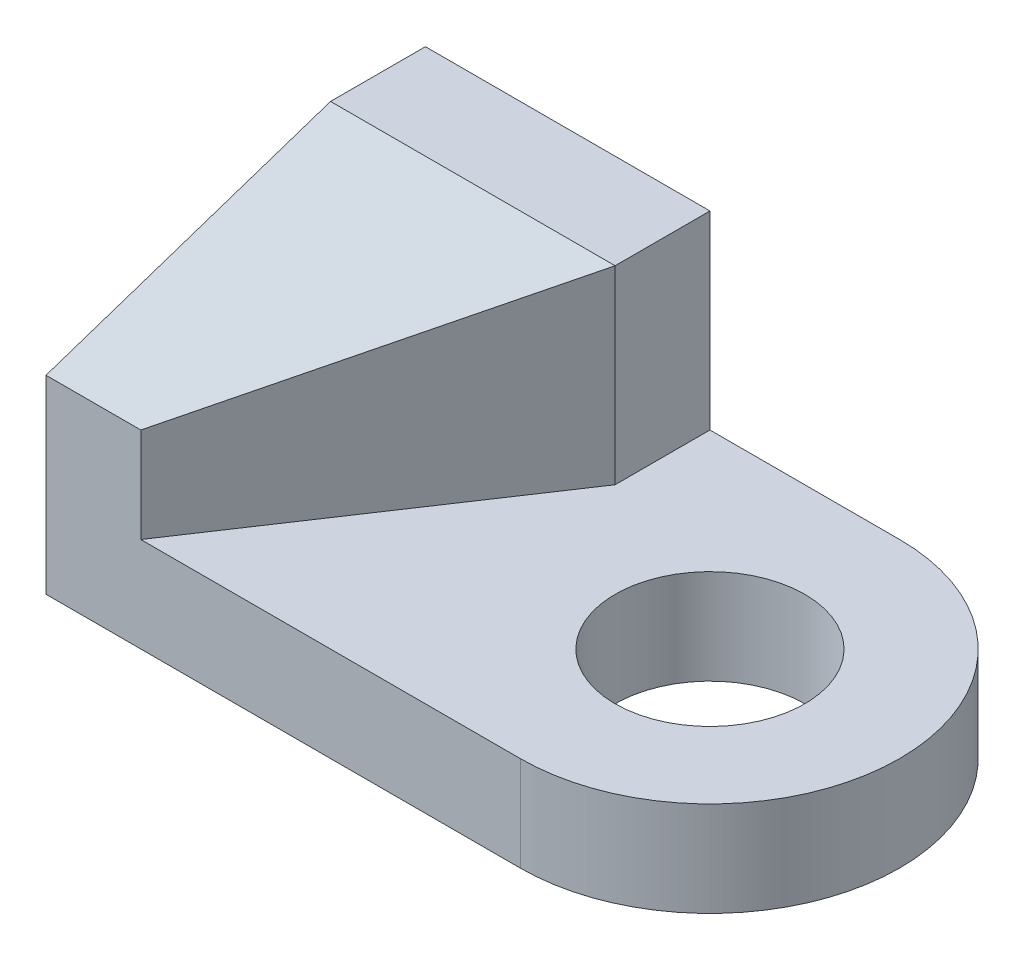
ISO-10303-21;
HEADER;
FILE_DESCRIPTION(('STEP AP214'),'2;1');
FILE_NAME('part.step','',(''),(''),'','','');
FILE_SCHEMA(('AUTOMOTIVE_DESIGN { 1 0 10303 214 1 1 1 1 }'));
ENDSEC;
DATA;
#1=APPLICATION_CONTEXT('core data for automotive mechanical design processes');
#2=APPLICATION_PROTOCOL_DEFINITION('international standard','automotive_design',2000,#1);
#3=PRODUCT_CONTEXT('',#1,'mechanical');
#4=PRODUCT('Part','Part','',(#3));
#5=PRODUCT_RELATED_PRODUCT_CATEGORY('part','',(#4));
#6=PRODUCT_DEFINITION_FORMATION('','',#4);
#7=PRODUCT_DEFINITION_CONTEXT('part definition',#1,'design');
#8=PRODUCT_DEFINITION('design','',#6,#7);
#9=PRODUCT_DEFINITION_SHAPE('','',#8);
#10=(LENGTH_UNIT() NAMED_UNIT(*) SI_UNIT(.MILLI.,.METRE.));
#11=(NAMED_UNIT(*) PLANE_ANGLE_UNIT() SI_UNIT($,.RADIAN.));
#12=(NAMED_UNIT(*) SI_UNIT($,.STERADIAN.) SOLID_ANGLE_UNIT());
#13=UNCERTAINTY_MEASURE_WITH_UNIT(LENGTH_MEASURE(1.E-05),#10,'distance_accuracy_value','');
#14=(GEOMETRIC_REPRESENTATION_CONTEXT(3) GLOBAL_UNCERTAINTY_ASSIGNED_CONTEXT((#13)) GLOBAL_UNIT_ASSIGNED_CONTEXT((#10,
#11,#12)) REPRESENTATION_CONTEXT('',''));
#15=CARTESIAN_POINT('',(0.,0.,0.));
#16=DIRECTION('',(0.,0.,1.));
#17=DIRECTION('',(1.,0.,0.));
#18=AXIS2_PLACEMENT_3D('',#15,#16,#17);
#19=CARTESIAN_POINT('',(0.,10.,0.));
#20=DIRECTION('',(0.,-1.,0.));
#21=DIRECTION('',(0.,0.,-1.));
#22=AXIS2_PLACEMENT_3D('',#19,#20,#21);
#23=CYLINDRICAL_SURFACE('',#22,20.);
#24=CARTESIAN_POINT('',(0.,0.,0.));
#25=DIRECTION('',(0.,1.,0.));
#26=DIRECTION('',(0.,0.,1.));
#27=AXIS2_PLACEMENT_3D('',#24,#25,#26);
#28=CIRCLE('',#27,20.);
#29=CARTESIAN_POINT('',(0.,0.,20.));
#30=VERTEX_POINT('',#29);
#31=CARTESIAN_POINT('',(0.,0.,-20.));
#32=VERTEX_POINT('',#31);
#33=EDGE_CURVE('E167',#30,#32,#28,.T.);
#34=ORIENTED_EDGE('',*,*,#33,.T.);
#35=DIRECTION('',(0.,-1.,0.));
#36=VECTOR('',#35,1.);
#37=CARTESIAN_POINT('',(0.,10.,-20.));
#38=LINE('',#37,#36);
#39=CARTESIAN_POINT('',(0.,10.,-20.));
#40=VERTEX_POINT('',#39);
#41=EDGE_CURVE('E112',#40,#32,#38,.T.);
#42=ORIENTED_EDGE('',*,*,#41,.F.);
#43=CARTESIAN_POINT('',(0.,10.,0.));
#44=DIRECTION('',(0.,1.,0.));
#45=DIRECTION('',(0.,0.,1.));
#46=AXIS2_PLACEMENT_3D('',#43,#44,#45);
#47=CIRCLE('',#46,20.);
#48=CARTESIAN_POINT('',(0.,10.,20.));
#49=VERTEX_POINT('',#48);
#50=EDGE_CURVE('E153',#49,#40,#47,.T.);
#51=ORIENTED_EDGE('',*,*,#50,.F.);
#52=DIRECTION('',(0.,-1.,0.));
#53=VECTOR('',#52,1.);
#54=CARTESIAN_POINT('',(0.,10.,20.));
#55=LINE('',#54,#53);
#56=EDGE_CURVE('E156',#49,#30,#55,.T.);
#57=ORIENTED_EDGE('',*,*,#56,.T.);
#58=EDGE_LOOP('',(#34,#42,#51,#57));
#59=FACE_BOUND('',#58,.T.);
#60=ADVANCED_FACE('F30',(#59),#23,.T.);
#61=CARTESIAN_POINT('',(0.,10.,-20.));
#62=DIRECTION('',(0.,0.,1.));
#63=DIRECTION('',(1.,0.,0.));
#64=AXIS2_PLACEMENT_3D('',#61,#62,#63);
#65=PLANE('',#64);
#66=DIRECTION('',(-1.,0.,0.));
#67=VECTOR('',#66,1.);
#68=CARTESIAN_POINT('',(0.,0.,-20.));
#69=LINE('',#68,#67);
#70=CARTESIAN_POINT('',(-50.,0.,-20.));
#71=VERTEX_POINT('',#70);
#72=EDGE_CURVE('E111',#32,#71,#69,.T.);
#73=ORIENTED_EDGE('',*,*,#72,.T.);
#74=DIRECTION('',(0.,-1.,0.));
#75=VECTOR('',#74,1.);
#76=CARTESIAN_POINT('',(-50.,10.,-20.));
#77=LINE('',#76,#75);
#78=CARTESIAN_POINT('',(-50.,30.,-20.));
#79=VERTEX_POINT('',#78);
#80=EDGE_CURVE('E95',#79,#71,#77,.T.);
#81=ORIENTED_EDGE('',*,*,#80,.F.);
#82=DIRECTION('',(1.,0.,0.));
#83=VECTOR('',#82,1.);
#84=CARTESIAN_POINT('',(-50.,30.,-20.));
#85=LINE('',#84,#83);
#86=CARTESIAN_POINT('',(-20.,30.,-20.));
#87=VERTEX_POINT('',#86);
#88=EDGE_CURVE('E109',#79,#87,#85,.T.);
#89=ORIENTED_EDGE('',*,*,#88,.T.);
#90=DIRECTION('',(0.,-1.,0.));
#91=VECTOR('',#90,1.);
#92=CARTESIAN_POINT('',(-20.,10.,-20.));
#93=LINE('',#92,#91);
#94=CARTESIAN_POINT('',(-20.,10.,-20.));
#95=VERTEX_POINT('',#94);
#96=EDGE_CURVE('E103',#87,#95,#93,.T.);
#97=ORIENTED_EDGE('',*,*,#96,.T.);
#98=DIRECTION('',(-1.,0.,0.));
#99=VECTOR('',#98,1.);
#100=CARTESIAN_POINT('',(0.,10.,-20.));
#101=LINE('',#100,#99);
#102=EDGE_CURVE('E151',#40,#95,#101,.T.);
#103=ORIENTED_EDGE('',*,*,#102,.F.);
#104=ORIENTED_EDGE('',*,*,#41,.T.);
#105=EDGE_LOOP('',(#73,#81,#89,#97,#103,#104));
#106=FACE_BOUND('',#105,.T.);
#107=ADVANCED_FACE('F107',(#106),#65,.F.);
#108=CARTESIAN_POINT('',(-50.,10.,-20.));
#109=DIRECTION('',(1.,0.,0.));
#110=DIRECTION('',(0.,0.,-1.));
#111=AXIS2_PLACEMENT_3D('',#108,#109,#110);
#112=PLANE('',#111);
#113=DIRECTION('',(0.,-1.,0.));
#114=VECTOR('',#113,1.);
#115=CARTESIAN_POINT('',(-50.,10.,20.));
#116=LINE('',#115,#114);
#117=CARTESIAN_POINT('',(-50.,20.,20.));
#118=VERTEX_POINT('',#117);
#119=CARTESIAN_POINT('',(-50.,0.,20.));
#120=VERTEX_POINT('',#119);
#121=EDGE_CURVE('E113',#118,#120,#116,.T.);
#122=ORIENTED_EDGE('',*,*,#121,.F.);
#123=DIRECTION('',(0.,0.316227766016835,-0.948683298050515));
#124=VECTOR('',#123,1.);
#125=CARTESIAN_POINT('',(-50.,30.,-10.0000000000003));
#126=LINE('',#125,#124);
#127=CARTESIAN_POINT('',(-50.,30.,-10.0000000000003));
#128=VERTEX_POINT('',#127);
#129=EDGE_CURVE('E11',#118,#128,#126,.T.);
#130=ORIENTED_EDGE('',*,*,#129,.T.);
#131=DIRECTION('',(0.,0.,-1.));
#132=VECTOR('',#131,1.);
#133=CARTESIAN_POINT('',(-50.,30.,20.));
#134=LINE('',#133,#132);
#135=EDGE_CURVE('E91',#128,#79,#134,.T.);
#136=ORIENTED_EDGE('',*,*,#135,.T.);
#137=ORIENTED_EDGE('',*,*,#80,.T.);
#138=DIRECTION('',(0.,0.,1.));
#139=VECTOR('',#138,1.);
#140=CARTESIAN_POINT('',(-50.,0.,-20.));
#141=LINE('',#140,#139);
#142=EDGE_CURVE('E172',#71,#120,#141,.T.);
#143=ORIENTED_EDGE('',*,*,#142,.T.);
#144=EDGE_LOOP('',(#122,#130,#136,#137,#143));
#145=FACE_BOUND('',#144,.T.);
#146=ADVANCED_FACE('F93',(#145),#112,.F.);
#147=CARTESIAN_POINT('',(-50.,10.,20.));
#148=DIRECTION('',(0.,0.,-1.));
#149=DIRECTION('',(-1.,0.,0.));
#150=AXIS2_PLACEMENT_3D('',#147,#148,#149);
#151=PLANE('',#150);
#152=DIRECTION('',(0.,1.,0.));
#153=VECTOR('',#152,1.);
#154=CARTESIAN_POINT('',(-40.0000000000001,30.,20.));
#155=LINE('',#154,#153);
#156=CARTESIAN_POINT('',(-40.0000000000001,10.,20.));
#157=VERTEX_POINT('',#156);
#158=CARTESIAN_POINT('',(-40.0000000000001,20.,20.));
#159=VERTEX_POINT('',#158);
#160=EDGE_CURVE('E132',#157,#159,#155,.T.);
#161=ORIENTED_EDGE('',*,*,#160,.T.);
#162=DIRECTION('',(-1.,0.,0.));
#163=VECTOR('',#162,1.);
#164=CARTESIAN_POINT('',(-50.,20.,20.));
#165=LINE('',#164,#163);
#166=EDGE_CURVE('E38',#159,#118,#165,.T.);
#167=ORIENTED_EDGE('',*,*,#166,.T.);
#168=ORIENTED_EDGE('',*,*,#121,.T.);
#169=DIRECTION('',(1.,0.,0.));
#170=VECTOR('',#169,1.);
#171=CARTESIAN_POINT('',(-50.,0.,20.));
#172=LINE('',#171,#170);
#173=EDGE_CURVE('E158',#120,#30,#172,.T.);
#174=ORIENTED_EDGE('',*,*,#173,.T.);
#175=ORIENTED_EDGE('',*,*,#56,.F.);
#176=DIRECTION('',(1.,0.,0.));
#177=VECTOR('',#176,1.);
#178=CARTESIAN_POINT('',(-50.,10.,20.));
#179=LINE('',#178,#177);
#180=EDGE_CURVE('E148',#157,#49,#179,.T.);
#181=ORIENTED_EDGE('',*,*,#180,.F.);
#182=EDGE_LOOP('',(#161,#167,#168,#174,#175,#181));
#183=FACE_BOUND('',#182,.T.);
#184=ADVANCED_FACE('F177',(#183),#151,.F.);
#185=CARTESIAN_POINT('',(0.,10.,0.));
#186=DIRECTION('',(0.,1.,0.));
#187=DIRECTION('',(0.,0.,1.));
#188=AXIS2_PLACEMENT_3D('',#185,#186,#187);
#189=PLANE('',#188);
#190=DIRECTION('',(0.,0.,-1.));
#191=VECTOR('',#190,1.);
#192=CARTESIAN_POINT('',(-20.,10.,20.));
#193=LINE('',#192,#191);
#194=CARTESIAN_POINT('',(-20.,10.,-10.0000000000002));
#195=VERTEX_POINT('',#194);
#196=EDGE_CURVE('E124',#195,#95,#193,.T.);
#197=ORIENTED_EDGE('',*,*,#196,.F.);
#198=DIRECTION('',(-0.554700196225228,0.,0.832050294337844));
#199=VECTOR('',#198,1.);
#200=CARTESIAN_POINT('',(-20.,10.,-10.0000000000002));
#201=LINE('',#200,#199);
#202=EDGE_CURVE('E134',#195,#157,#201,.T.);
#203=ORIENTED_EDGE('',*,*,#202,.T.);
#204=ORIENTED_EDGE('',*,*,#180,.T.);
#205=ORIENTED_EDGE('',*,*,#50,.T.);
#206=ORIENTED_EDGE('',*,*,#102,.T.);
#207=EDGE_LOOP('',(#197,#203,#204,#205,#206));
#208=FACE_BOUND('',#207,.T.);
#209=CARTESIAN_POINT('',(0.,10.,0.));
#210=DIRECTION('',(0.,1.,0.));
#211=DIRECTION('',(0.,0.,1.));
#212=AXIS2_PLACEMENT_3D('',#209,#210,#211);
#213=CIRCLE('',#212,10.);
#214=CARTESIAN_POINT('',(0.,10.,10.));
#215=VERTEX_POINT('',#214);
#216=EDGE_CURVE('E127',#215,#215,#213,.T.);
#217=ORIENTED_EDGE('',*,*,#216,.F.);
#218=EDGE_LOOP('',(#217));
#219=FACE_BOUND('',#218,.T.);
#220=ADVANCED_FACE('F145',(#208,#219),#189,.T.);
#221=CARTESIAN_POINT('',(0.,0.,0.));
#222=DIRECTION('',(0.,1.,0.));
#223=DIRECTION('',(0.,0.,1.));
#224=AXIS2_PLACEMENT_3D('',#221,#222,#223);
#225=PLANE('',#224);
#226=CARTESIAN_POINT('',(0.,0.,0.));
#227=DIRECTION('',(0.,1.,0.));
#228=DIRECTION('',(0.,0.,1.));
#229=AXIS2_PLACEMENT_3D('',#226,#227,#228);
#230=CIRCLE('',#229,10.);
#231=CARTESIAN_POINT('',(0.,0.,10.));
#232=VERTEX_POINT('',#231);
#233=EDGE_CURVE('E170',#232,#232,#230,.T.);
#234=ORIENTED_EDGE('',*,*,#233,.T.);
#235=EDGE_LOOP('',(#234));
#236=FACE_BOUND('',#235,.T.);
#237=ORIENTED_EDGE('',*,*,#33,.F.);
#238=ORIENTED_EDGE('',*,*,#173,.F.);
#239=ORIENTED_EDGE('',*,*,#142,.F.);
#240=ORIENTED_EDGE('',*,*,#72,.F.);
#241=EDGE_LOOP('',(#237,#238,#239,#240));
#242=FACE_BOUND('',#241,.T.);
#243=ADVANCED_FACE('F181',(#236,#242),#225,.F.);
#244=CARTESIAN_POINT('',(0.,0.,0.));
#245=DIRECTION('',(0.,1.,0.));
#246=DIRECTION('',(0.,0.,1.));
#247=AXIS2_PLACEMENT_3D('',#244,#245,#246);
#248=CYLINDRICAL_SURFACE('',#247,10.);
#249=ORIENTED_EDGE('',*,*,#233,.F.);
#250=EDGE_LOOP('',(#249));
#251=FACE_BOUND('',#250,.T.);
#252=ORIENTED_EDGE('',*,*,#216,.T.);
#253=EDGE_LOOP('',(#252));
#254=FACE_BOUND('',#253,.T.);
#255=ADVANCED_FACE('F200',(#251,#254),#248,.F.);
#256=CARTESIAN_POINT('',(-20.,10.,20.));
#257=DIRECTION('',(1.,0.,0.));
#258=DIRECTION('',(0.,0.,-1.));
#259=AXIS2_PLACEMENT_3D('',#256,#257,#258);
#260=PLANE('',#259);
#261=DIRECTION('',(0.,0.,-1.));
#262=VECTOR('',#261,1.);
#263=CARTESIAN_POINT('',(-20.,30.,20.));
#264=LINE('',#263,#262);
#265=CARTESIAN_POINT('',(-20.,30.,-10.0000000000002));
#266=VERTEX_POINT('',#265);
#267=EDGE_CURVE('E102',#266,#87,#264,.T.);
#268=ORIENTED_EDGE('',*,*,#267,.F.);
#269=DIRECTION('',(0.,-1.,0.));
#270=VECTOR('',#269,1.);
#271=CARTESIAN_POINT('',(-20.,10.,-10.0000000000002));
#272=LINE('',#271,#270);
#273=EDGE_CURVE('E129',#266,#195,#272,.T.);
#274=ORIENTED_EDGE('',*,*,#273,.T.);
#275=ORIENTED_EDGE('',*,*,#196,.T.);
#276=ORIENTED_EDGE('',*,*,#96,.F.);
#277=EDGE_LOOP('',(#268,#274,#275,#276));
#278=FACE_BOUND('',#277,.T.);
#279=ADVANCED_FACE('F141',(#278),#260,.T.);
#280=CARTESIAN_POINT('',(-50.,30.,20.));
#281=DIRECTION('',(0.,1.,0.));
#282=DIRECTION('',(-1.,0.,0.));
#283=AXIS2_PLACEMENT_3D('',#280,#281,#282);
#284=PLANE('',#283);
#285=ORIENTED_EDGE('',*,*,#135,.F.);
#286=DIRECTION('',(1.,0.,0.));
#287=VECTOR('',#286,1.);
#288=CARTESIAN_POINT('',(-40.0000000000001,30.,-10.0000000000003));
#289=LINE('',#288,#287);
#290=EDGE_CURVE('E137',#128,#266,#289,.T.);
#291=ORIENTED_EDGE('',*,*,#290,.T.);
#292=ORIENTED_EDGE('',*,*,#267,.T.);
#293=ORIENTED_EDGE('',*,*,#88,.F.);
#294=EDGE_LOOP('',(#285,#291,#292,#293));
#295=FACE_BOUND('',#294,.T.);
#296=ADVANCED_FACE('F115',(#295),#284,.T.);
#297=CARTESIAN_POINT('',(-20.,10.,-10.0000000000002));
#298=DIRECTION('',(0.832050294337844,0.,0.554700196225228));
#299=DIRECTION('',(0.554700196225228,0.,-0.832050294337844));
#300=AXIS2_PLACEMENT_3D('',#297,#298,#299);
#301=PLANE('',#300);
#302=ORIENTED_EDGE('',*,*,#273,.F.);
#303=DIRECTION('',(-0.534522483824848,-0.267261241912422,0.801783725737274));
#304=VECTOR('',#303,1.);
#305=CARTESIAN_POINT('',(-22.8571428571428,28.5714285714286,-5.71428571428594));
#306=LINE('',#305,#304);
#307=EDGE_CURVE('E52',#266,#159,#306,.T.);
#308=ORIENTED_EDGE('',*,*,#307,.T.);
#309=ORIENTED_EDGE('',*,*,#160,.F.);
#310=ORIENTED_EDGE('',*,*,#202,.F.);
#311=EDGE_LOOP('',(#302,#308,#309,#310));
#312=FACE_BOUND('',#311,.T.);
#313=ADVANCED_FACE('F143',(#312),#301,.T.);
#314=CARTESIAN_POINT('',(-50.,30.,-10.0000000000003));
#315=DIRECTION('',(0.,0.948683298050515,0.316227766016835));
#316=DIRECTION('',(0.,-0.316227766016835,0.948683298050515));
#317=AXIS2_PLACEMENT_3D('',#314,#315,#316);
#318=PLANE('',#317);
#319=ORIENTED_EDGE('',*,*,#129,.F.);
#320=ORIENTED_EDGE('',*,*,#166,.F.);
#321=ORIENTED_EDGE('',*,*,#307,.F.);
#322=ORIENTED_EDGE('',*,*,#290,.F.);
#323=EDGE_LOOP('',(#319,#320,#321,#322));
#324=FACE_BOUND('',#323,.T.);
#325=ADVANCED_FACE('F32',(#324),#318,.T.);
#326=CLOSED_SHELL('',(#60,#107,#146,#184,#220,#243,#255,#279,#296,#313,#325));
#327=MANIFOLD_SOLID_BREP('B2',#326);
#328=ADVANCED_BREP_SHAPE_REPRESENTATION('',(#18,#327),#14);
#329=SHAPE_DEFINITION_REPRESENTATION(#9,#328);
ENDSEC;
END-ISO-10303-21;
